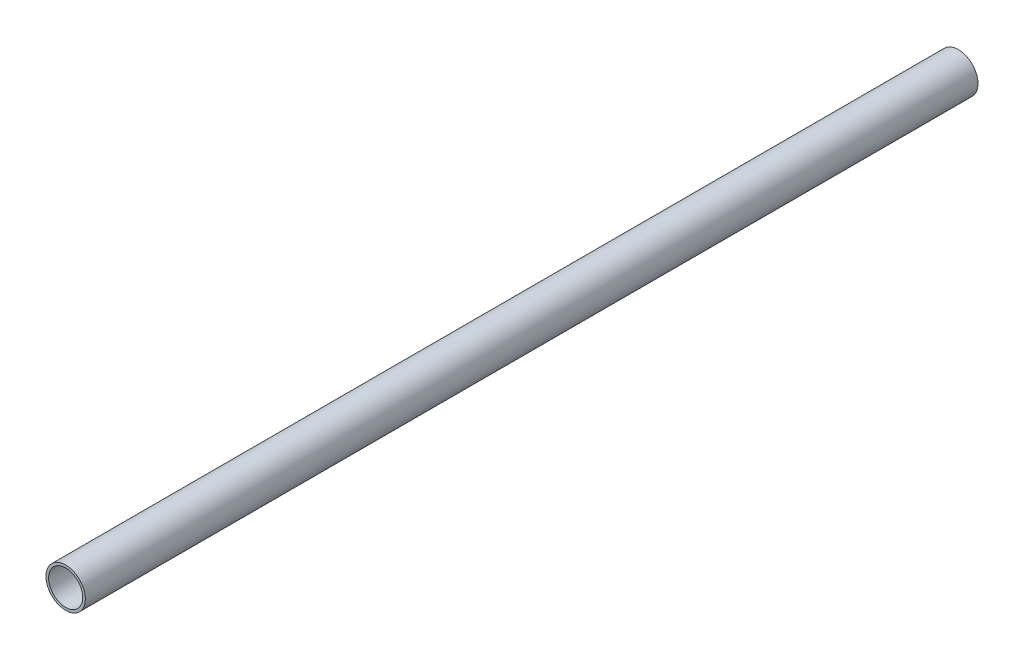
ISO-10303-21;
HEADER;
FILE_DESCRIPTION(('STEP AP214'),'2;1');
FILE_NAME('part.step','',(''),(''),'','','');
FILE_SCHEMA(('AUTOMOTIVE_DESIGN { 1 0 10303 214 1 1 1 1 }'));
ENDSEC;
DATA;
#1=APPLICATION_CONTEXT('core data for automotive mechanical design processes');
#2=APPLICATION_PROTOCOL_DEFINITION('international standard','automotive_design',2000,#1);
#3=PRODUCT_CONTEXT('',#1,'mechanical');
#4=PRODUCT('Part','Part','',(#3));
#5=PRODUCT_RELATED_PRODUCT_CATEGORY('part','',(#4));
#6=PRODUCT_DEFINITION_FORMATION('','',#4);
#7=PRODUCT_DEFINITION_CONTEXT('part definition',#1,'design');
#8=PRODUCT_DEFINITION('design','',#6,#7);
#9=PRODUCT_DEFINITION_SHAPE('','',#8);
#10=(LENGTH_UNIT() NAMED_UNIT(*) SI_UNIT(.MILLI.,.METRE.));
#11=(NAMED_UNIT(*) PLANE_ANGLE_UNIT() SI_UNIT($,.RADIAN.));
#12=(NAMED_UNIT(*) SI_UNIT($,.STERADIAN.) SOLID_ANGLE_UNIT());
#13=UNCERTAINTY_MEASURE_WITH_UNIT(LENGTH_MEASURE(1.E-05),#10,'distance_accuracy_value','');
#14=(GEOMETRIC_REPRESENTATION_CONTEXT(3) GLOBAL_UNCERTAINTY_ASSIGNED_CONTEXT((#13)) GLOBAL_UNIT_ASSIGNED_CONTEXT((#10,
#11,#12)) REPRESENTATION_CONTEXT('',''));
#15=CARTESIAN_POINT('',(0.,0.,0.));
#16=DIRECTION('',(0.,0.,1.));
#17=DIRECTION('',(1.,0.,0.));
#18=AXIS2_PLACEMENT_3D('',#15,#16,#17);
#19=CARTESIAN_POINT('',(0.,0.,680.));
#20=DIRECTION('',(0.,0.,1.));
#21=DIRECTION('',(1.,0.,0.));
#22=AXIS2_PLACEMENT_3D('',#19,#20,#21);
#23=PLANE('',#22);
#24=CARTESIAN_POINT('',(0.,0.,680.));
#25=DIRECTION('',(0.,0.,1.));
#26=DIRECTION('',(1.,0.,0.));
#27=AXIS2_PLACEMENT_3D('',#24,#25,#26);
#28=CIRCLE('',#27,15.);
#29=CARTESIAN_POINT('',(15.,0.,680.));
#30=VERTEX_POINT('',#29);
#31=EDGE_CURVE('E10',#30,#30,#28,.T.);
#32=ORIENTED_EDGE('',*,*,#31,.T.);
#33=EDGE_LOOP('',(#32));
#34=FACE_BOUND('',#33,.T.);
#35=CARTESIAN_POINT('',(0.,0.,680.));
#36=DIRECTION('',(0.,0.,1.));
#37=DIRECTION('',(1.,0.,0.));
#38=AXIS2_PLACEMENT_3D('',#35,#36,#37);
#39=CIRCLE('',#38,13.);
#40=CARTESIAN_POINT('',(13.,0.,680.));
#41=VERTEX_POINT('',#40);
#42=EDGE_CURVE('E42',#41,#41,#39,.T.);
#43=ORIENTED_EDGE('',*,*,#42,.F.);
#44=EDGE_LOOP('',(#43));
#45=FACE_BOUND('',#44,.T.);
#46=ADVANCED_FACE('F31',(#34,#45),#23,.T.);
#47=CARTESIAN_POINT('',(0.,0.,0.));
#48=DIRECTION('',(0.,0.,1.));
#49=DIRECTION('',(1.,0.,0.));
#50=AXIS2_PLACEMENT_3D('',#47,#48,#49);
#51=PLANE('',#50);
#52=CARTESIAN_POINT('',(0.,0.,0.));
#53=DIRECTION('',(0.,0.,1.));
#54=DIRECTION('',(1.,0.,0.));
#55=AXIS2_PLACEMENT_3D('',#52,#53,#54);
#56=CIRCLE('',#55,15.);
#57=CARTESIAN_POINT('',(15.,0.,0.));
#58=VERTEX_POINT('',#57);
#59=EDGE_CURVE('E35',#58,#58,#56,.T.);
#60=ORIENTED_EDGE('',*,*,#59,.F.);
#61=EDGE_LOOP('',(#60));
#62=FACE_BOUND('',#61,.T.);
#63=CARTESIAN_POINT('',(0.,0.,0.));
#64=DIRECTION('',(0.,0.,1.));
#65=DIRECTION('',(1.,0.,0.));
#66=AXIS2_PLACEMENT_3D('',#63,#64,#65);
#67=CIRCLE('',#66,13.);
#68=CARTESIAN_POINT('',(13.,0.,0.));
#69=VERTEX_POINT('',#68);
#70=EDGE_CURVE('E44',#69,#69,#67,.T.);
#71=ORIENTED_EDGE('',*,*,#70,.T.);
#72=EDGE_LOOP('',(#71));
#73=FACE_BOUND('',#72,.T.);
#74=ADVANCED_FACE('F54',(#62,#73),#51,.F.);
#75=CARTESIAN_POINT('',(0.,0.,680.));
#76=DIRECTION('',(0.,0.,-1.));
#77=DIRECTION('',(-1.,0.,0.));
#78=AXIS2_PLACEMENT_3D('',#75,#76,#77);
#79=CYLINDRICAL_SURFACE('',#78,15.);
#80=ORIENTED_EDGE('',*,*,#31,.F.);
#81=EDGE_LOOP('',(#80));
#82=FACE_BOUND('',#81,.T.);
#83=ORIENTED_EDGE('',*,*,#59,.T.);
#84=EDGE_LOOP('',(#83));
#85=FACE_BOUND('',#84,.T.);
#86=ADVANCED_FACE('F33',(#82,#85),#79,.T.);
#87=CARTESIAN_POINT('',(0.,0.,680.));
#88=DIRECTION('',(0.,0.,-1.));
#89=DIRECTION('',(-1.,0.,0.));
#90=AXIS2_PLACEMENT_3D('',#87,#88,#89);
#91=CYLINDRICAL_SURFACE('',#90,13.);
#92=ORIENTED_EDGE('',*,*,#42,.T.);
#93=EDGE_LOOP('',(#92));
#94=FACE_BOUND('',#93,.T.);
#95=ORIENTED_EDGE('',*,*,#70,.F.);
#96=EDGE_LOOP('',(#95));
#97=FACE_BOUND('',#96,.T.);
#98=ADVANCED_FACE('F50',(#94,#97),#91,.F.);
#99=CLOSED_SHELL('',(#46,#74,#86,#98));
#100=MANIFOLD_SOLID_BREP('B2',#99);
#101=ADVANCED_BREP_SHAPE_REPRESENTATION('',(#18,#100),#14);
#102=SHAPE_DEFINITION_REPRESENTATION(#9,#101);
ENDSEC;
END-ISO-10303-21;
